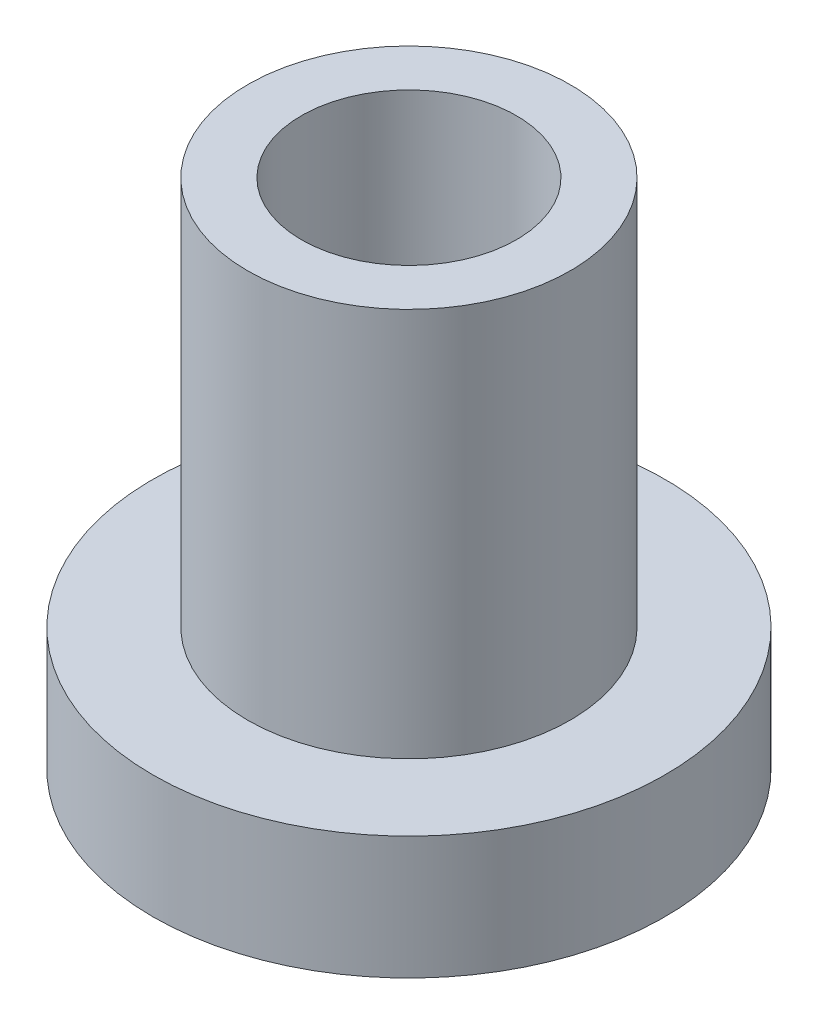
from build123d import *


with BuildPart() as part:
    # Sketch1 → Base-Revolve (revolve)
    with BuildSketch(Plane(origin=(0, 0, 0), x_dir=(0, 0, -1), z_dir=(1, 0, 0)), mode=Mode.PRIVATE) as base_revolve_sk:
        Polygon((2.667, 0), (6.35, 0), (6.35, 3.048), (4.0005, 3.048), (4.0005, 12.7), (2.667, 12.7), align=None)
    revolve(base_revolve_sk.sketch.rotate(Axis((0, 0, 0), (0, -1, 0)), 180), axis=Axis((0, 0, 0), (0, -1, 0)))


solid = part.part
